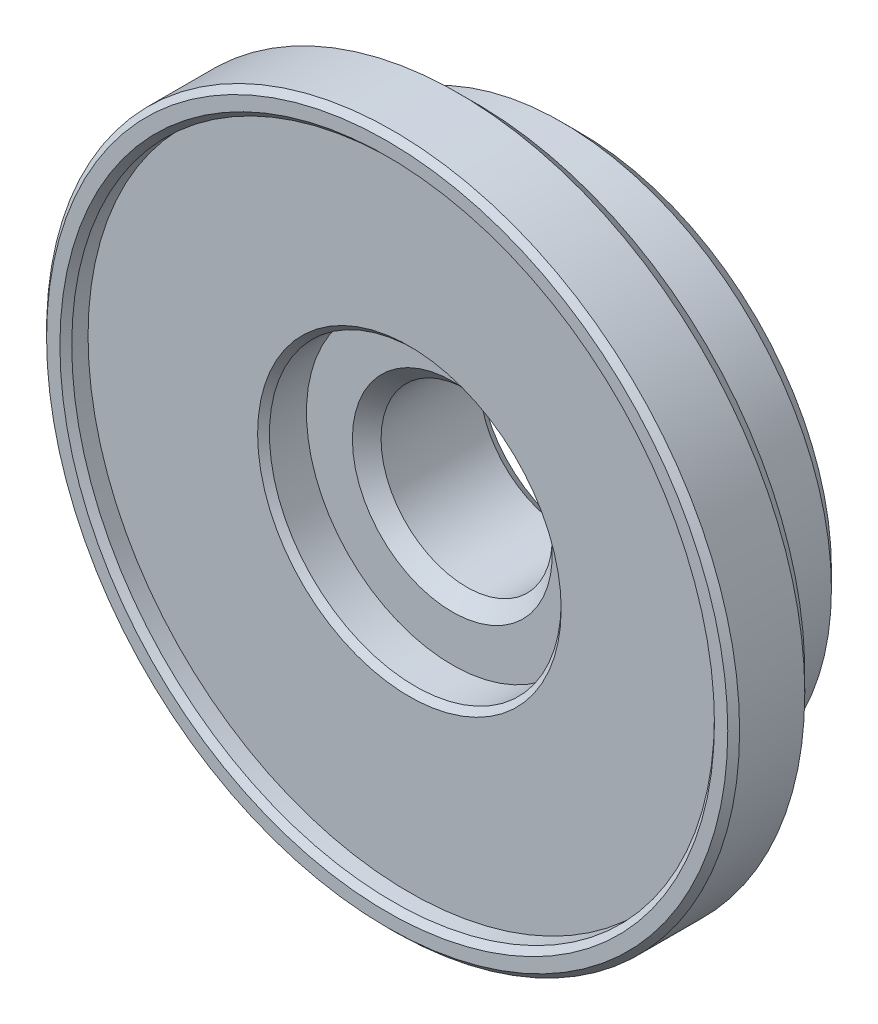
ISO-10303-21;
HEADER;
FILE_DESCRIPTION(('STEP AP214'),'2;1');
FILE_NAME('part.step','',(''),(''),'','','');
FILE_SCHEMA(('AUTOMOTIVE_DESIGN { 1 0 10303 214 1 1 1 1 }'));
ENDSEC;
DATA;
#1=APPLICATION_CONTEXT('core data for automotive mechanical design processes');
#2=APPLICATION_PROTOCOL_DEFINITION('international standard','automotive_design',2000,#1);
#3=PRODUCT_CONTEXT('',#1,'mechanical');
#4=PRODUCT('Part','Part','',(#3));
#5=PRODUCT_RELATED_PRODUCT_CATEGORY('part','',(#4));
#6=PRODUCT_DEFINITION_FORMATION('','',#4);
#7=PRODUCT_DEFINITION_CONTEXT('part definition',#1,'design');
#8=PRODUCT_DEFINITION('design','',#6,#7);
#9=PRODUCT_DEFINITION_SHAPE('','',#8);
#10=(LENGTH_UNIT() NAMED_UNIT(*) SI_UNIT(.MILLI.,.METRE.));
#11=(NAMED_UNIT(*) PLANE_ANGLE_UNIT() SI_UNIT($,.RADIAN.));
#12=(NAMED_UNIT(*) SI_UNIT($,.STERADIAN.) SOLID_ANGLE_UNIT());
#13=UNCERTAINTY_MEASURE_WITH_UNIT(LENGTH_MEASURE(1.E-05),#10,'distance_accuracy_value','');
#14=(GEOMETRIC_REPRESENTATION_CONTEXT(3) GLOBAL_UNCERTAINTY_ASSIGNED_CONTEXT((#13)) GLOBAL_UNIT_ASSIGNED_CONTEXT((#10,
#11,#12)) REPRESENTATION_CONTEXT('',''));
#15=CARTESIAN_POINT('',(0.,0.,0.));
#16=DIRECTION('',(0.,0.,1.));
#17=DIRECTION('',(1.,0.,0.));
#18=AXIS2_PLACEMENT_3D('',#15,#16,#17);
#19=CARTESIAN_POINT('',(0.,0.,-16.51));
#20=DIRECTION('',(0.,0.,1.));
#21=DIRECTION('',(1.,0.,0.));
#22=AXIS2_PLACEMENT_3D('',#19,#20,#21);
#23=CYLINDRICAL_SURFACE('',#22,29.718);
#24=CARTESIAN_POINT('',(0.,0.,-0.508000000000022));
#25=DIRECTION('',(0.,0.,1.));
#26=DIRECTION('',(1.,0.,0.));
#27=AXIS2_PLACEMENT_3D('',#24,#25,#26);
#28=CIRCLE('',#27,29.718);
#29=CARTESIAN_POINT('',(29.718,0.,-0.508000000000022));
#30=VERTEX_POINT('',#29);
#31=EDGE_CURVE('E32',#30,#30,#28,.F.);
#32=ORIENTED_EDGE('',*,*,#31,.T.);
#33=EDGE_LOOP('',(#32));
#34=FACE_BOUND('',#33,.T.);
#35=CARTESIAN_POINT('',(0.,0.,-6.09599999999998));
#36=DIRECTION('',(0.,0.,-1.));
#37=DIRECTION('',(-1.,0.,0.));
#38=AXIS2_PLACEMENT_3D('',#35,#36,#37);
#39=CIRCLE('',#38,29.718);
#40=CARTESIAN_POINT('',(-29.718,0.,-6.09599999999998));
#41=VERTEX_POINT('',#40);
#42=EDGE_CURVE('E57',#41,#41,#39,.F.);
#43=ORIENTED_EDGE('',*,*,#42,.T.);
#44=EDGE_LOOP('',(#43));
#45=FACE_BOUND('',#44,.T.);
#46=ADVANCED_FACE('F14',(#34,#45),#23,.T.);
#47=CARTESIAN_POINT('',(0.,0.,0.));
#48=DIRECTION('',(0.,0.,1.));
#49=DIRECTION('',(1.,0.,0.));
#50=AXIS2_PLACEMENT_3D('',#47,#48,#49);
#51=PLANE('',#50);
#52=CARTESIAN_POINT('',(0.,0.,0.));
#53=DIRECTION('',(0.,0.,1.));
#54=DIRECTION('',(1.,0.,0.));
#55=AXIS2_PLACEMENT_3D('',#52,#53,#54);
#56=CIRCLE('',#55,28.067);
#57=CARTESIAN_POINT('',(28.067,0.,0.));
#58=VERTEX_POINT('',#57);
#59=EDGE_CURVE('E93',#58,#58,#56,.F.);
#60=ORIENTED_EDGE('',*,*,#59,.T.);
#61=EDGE_LOOP('',(#60));
#62=FACE_BOUND('',#61,.T.);
#63=CARTESIAN_POINT('',(0.,0.,0.));
#64=DIRECTION('',(0.,0.,1.));
#65=DIRECTION('',(1.,0.,0.));
#66=AXIS2_PLACEMENT_3D('',#63,#64,#65);
#67=CIRCLE('',#66,29.21);
#68=CARTESIAN_POINT('',(29.21,0.,0.));
#69=VERTEX_POINT('',#68);
#70=EDGE_CURVE('E40',#69,#69,#67,.T.);
#71=ORIENTED_EDGE('',*,*,#70,.T.);
#72=EDGE_LOOP('',(#71));
#73=FACE_BOUND('',#72,.T.);
#74=ADVANCED_FACE('F131',(#62,#73),#51,.T.);
#75=CARTESIAN_POINT('',(0.,0.,-7.62));
#76=DIRECTION('',(0.,0.,-1.));
#77=DIRECTION('',(-1.,0.,0.));
#78=AXIS2_PLACEMENT_3D('',#75,#76,#77);
#79=PLANE('',#78);
#80=CARTESIAN_POINT('',(0.,0.,-7.62));
#81=DIRECTION('',(0.,0.,-1.));
#82=DIRECTION('',(-1.,0.,0.));
#83=AXIS2_PLACEMENT_3D('',#80,#81,#82);
#84=CIRCLE('',#83,23.876);
#85=CARTESIAN_POINT('',(-23.876,0.,-7.62));
#86=VERTEX_POINT('',#85);
#87=EDGE_CURVE('E9',#86,#86,#84,.F.);
#88=ORIENTED_EDGE('',*,*,#87,.T.);
#89=EDGE_LOOP('',(#88));
#90=FACE_BOUND('',#89,.T.);
#91=CARTESIAN_POINT('',(0.,0.,-7.62));
#92=DIRECTION('',(0.,0.,-1.));
#93=DIRECTION('',(-1.,0.,0.));
#94=AXIS2_PLACEMENT_3D('',#91,#92,#93);
#95=CIRCLE('',#94,28.194);
#96=CARTESIAN_POINT('',(-28.194,0.,-7.62));
#97=VERTEX_POINT('',#96);
#98=EDGE_CURVE('E54',#97,#97,#95,.T.);
#99=ORIENTED_EDGE('',*,*,#98,.T.);
#100=EDGE_LOOP('',(#99));
#101=FACE_BOUND('',#100,.T.);
#102=ADVANCED_FACE('F138',(#90,#101),#79,.T.);
#103=CARTESIAN_POINT('',(0.,0.,-7.62));
#104=DIRECTION('',(0.,0.,-1.));
#105=DIRECTION('',(-1.,0.,0.));
#106=AXIS2_PLACEMENT_3D('',#103,#104,#105);
#107=CYLINDRICAL_SURFACE('',#106,23.114);
#108=CARTESIAN_POINT('',(0.,0.,-8.382));
#109=DIRECTION('',(0.,0.,-1.));
#110=DIRECTION('',(-1.,0.,0.));
#111=AXIS2_PLACEMENT_3D('',#108,#109,#110);
#112=CIRCLE('',#111,23.114);
#113=CARTESIAN_POINT('',(-23.114,0.,-8.382));
#114=VERTEX_POINT('',#113);
#115=EDGE_CURVE('E22',#114,#114,#112,.T.);
#116=CARTESIAN_POINT('',(0.,0.,-14.9860000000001));
#117=DIRECTION('',(0.,0.,1.));
#118=DIRECTION('',(1.,0.,0.));
#119=AXIS2_PLACEMENT_3D('',#116,#117,#118);
#120=CIRCLE('',#119,23.114);
#121=CARTESIAN_POINT('',(-23.114,0.,-14.9860000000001));
#122=VERTEX_POINT('',#121);
#123=EDGE_CURVE('E46',#122,#122,#120,.T.);
#124=CARTESIAN_POINT('',(-23.114,0.,-8.382));
#125=CARTESIAN_POINT('',(-23.114,0.,-8.45079166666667));
#126=CARTESIAN_POINT('',(-23.114,0.,-8.51958333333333));
#127=CARTESIAN_POINT('',(-23.114,0.,-8.65716666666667));
#128=CARTESIAN_POINT('',(-23.114,0.,-8.72595833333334));
#129=CARTESIAN_POINT('',(-23.114,0.,-8.86354166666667));
#130=CARTESIAN_POINT('',(-23.114,0.,-8.93233333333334));
#131=CARTESIAN_POINT('',(-23.114,0.,-9.06991666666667));
#132=CARTESIAN_POINT('',(-23.114,0.,-9.13870833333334));
#133=CARTESIAN_POINT('',(-23.114,0.,-9.27629166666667));
#134=CARTESIAN_POINT('',(-23.114,0.,-9.34508333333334));
#135=CARTESIAN_POINT('',(-23.114,0.,-9.48266666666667));
#136=CARTESIAN_POINT('',(-23.114,0.,-9.55145833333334));
#137=CARTESIAN_POINT('',(-23.114,0.,-9.68904166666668));
#138=CARTESIAN_POINT('',(-23.114,0.,-9.75783333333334));
#139=CARTESIAN_POINT('',(-23.114,0.,-9.89541666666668));
#140=CARTESIAN_POINT('',(-23.114,0.,-9.96420833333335));
#141=CARTESIAN_POINT('',(-23.114,0.,-10.1017916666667));
#142=CARTESIAN_POINT('',(-23.114,0.,-10.1705833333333));
#143=CARTESIAN_POINT('',(-23.114,0.,-10.3081666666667));
#144=CARTESIAN_POINT('',(-23.114,0.,-10.3769583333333));
#145=CARTESIAN_POINT('',(-23.114,0.,-10.5145416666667));
#146=CARTESIAN_POINT('',(-23.114,0.,-10.5833333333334));
#147=CARTESIAN_POINT('',(-23.114,0.,-10.7209166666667));
#148=CARTESIAN_POINT('',(-23.114,0.,-10.7897083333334));
#149=CARTESIAN_POINT('',(-23.114,0.,-10.9272916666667));
#150=CARTESIAN_POINT('',(-23.114,0.,-10.9960833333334));
#151=CARTESIAN_POINT('',(-23.114,0.,-11.1336666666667));
#152=CARTESIAN_POINT('',(-23.114,0.,-11.2024583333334));
#153=CARTESIAN_POINT('',(-23.114,0.,-11.3400416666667));
#154=CARTESIAN_POINT('',(-23.114,0.,-11.4088333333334));
#155=CARTESIAN_POINT('',(-23.114,0.,-11.5464166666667));
#156=CARTESIAN_POINT('',(-23.114,0.,-11.6152083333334));
#157=CARTESIAN_POINT('',(-23.114,0.,-11.7527916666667));
#158=CARTESIAN_POINT('',(-23.114,0.,-11.8215833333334));
#159=CARTESIAN_POINT('',(-23.114,0.,-11.9591666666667));
#160=CARTESIAN_POINT('',(-23.114,0.,-12.0279583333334));
#161=CARTESIAN_POINT('',(-23.114,0.,-12.1655416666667));
#162=CARTESIAN_POINT('',(-23.114,0.,-12.2343333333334));
#163=CARTESIAN_POINT('',(-23.114,0.,-12.3719166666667));
#164=CARTESIAN_POINT('',(-23.114,0.,-12.4407083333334));
#165=CARTESIAN_POINT('',(-23.114,0.,-12.5782916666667));
#166=CARTESIAN_POINT('',(-23.114,0.,-12.6470833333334));
#167=CARTESIAN_POINT('',(-23.114,0.,-12.7846666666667));
#168=CARTESIAN_POINT('',(-23.114,0.,-12.8534583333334));
#169=CARTESIAN_POINT('',(-23.114,0.,-12.9910416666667));
#170=CARTESIAN_POINT('',(-23.114,0.,-13.0598333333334));
#171=CARTESIAN_POINT('',(-23.114,0.,-13.1974166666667));
#172=CARTESIAN_POINT('',(-23.114,0.,-13.2662083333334));
#173=CARTESIAN_POINT('',(-23.114,0.,-13.4037916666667));
#174=CARTESIAN_POINT('',(-23.114,0.,-13.4725833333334));
#175=CARTESIAN_POINT('',(-23.114,0.,-13.6101666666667));
#176=CARTESIAN_POINT('',(-23.114,0.,-13.6789583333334));
#177=CARTESIAN_POINT('',(-23.114,0.,-13.8165416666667));
#178=CARTESIAN_POINT('',(-23.114,0.,-13.8853333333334));
#179=CARTESIAN_POINT('',(-23.114,0.,-14.0229166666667));
#180=CARTESIAN_POINT('',(-23.114,0.,-14.0917083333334));
#181=CARTESIAN_POINT('',(-23.114,0.,-14.2292916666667));
#182=CARTESIAN_POINT('',(-23.114,0.,-14.2980833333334));
#183=CARTESIAN_POINT('',(-23.114,0.,-14.4356666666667));
#184=CARTESIAN_POINT('',(-23.114,0.,-14.5044583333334));
#185=CARTESIAN_POINT('',(-23.114,0.,-14.6420416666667));
#186=CARTESIAN_POINT('',(-23.114,0.,-14.7108333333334));
#187=CARTESIAN_POINT('',(-23.114,0.,-14.8484166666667));
#188=CARTESIAN_POINT('',(-23.114,0.,-14.9172083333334));
#189=CARTESIAN_POINT('',(-23.114,0.,-14.9860000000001));
#190=B_SPLINE_CURVE_WITH_KNOTS('',3,(#124,#125,#126,#127,#128,#129,#130,#131,#132,#133,#134,
#135,#136,#137,#138,#139,#140,#141,#142,#143,#144,#145,#146,#147,#148,#149,#150,#151,#152,#153,
#154,#155,#156,#157,#158,#159,#160,#161,#162,#163,#164,#165,#166,#167,#168,#169,#170,#171,#172,
#173,#174,#175,#176,#177,#178,#179,#180,#181,#182,#183,#184,#185,#186,#187,#188,#189),
.UNSPECIFIED.,.F.,.F.,(4,2,2,2,2,2,2,2,2,2,2,2,2,2,2,2,2,2,2,2,2,2,2,2,2,2,2,2,2,2,2,2,4),(0.,
0.206375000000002,0.412750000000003,0.619125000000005,0.825500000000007,1.03187500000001,
1.23825000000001,1.44462500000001,1.65100000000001,1.85737500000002,2.06375000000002,
2.27012500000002,2.47650000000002,2.68287500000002,2.88925000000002,3.09562500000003,
3.30200000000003,3.50837500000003,3.71475000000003,3.92112500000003,4.12750000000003,
4.33387500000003,4.54025000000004,4.74662500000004,4.95300000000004,5.15937500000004,
5.36575000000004,5.57212500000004,5.77850000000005,5.98487500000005,6.19125000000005,
6.39762500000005,6.60400000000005),.UNSPECIFIED.);
#191=EDGE_CURVE('BSEAM111',#114,#122,#190,.T.);
#192=ORIENTED_EDGE('',*,*,#115,.T.);
#193=ORIENTED_EDGE('',*,*,#123,.T.);
#194=ORIENTED_EDGE('',*,*,#191,.T.);
#195=ORIENTED_EDGE('',*,*,#191,.F.);
#196=EDGE_LOOP('',(#192,#194,#193,#195));
#197=FACE_BOUND('',#196,.T.);
#198=ADVANCED_FACE('F111',(#197),#107,.T.);
#199=CARTESIAN_POINT('',(0.,0.,-16.51));
#200=DIRECTION('',(0.,0.,1.));
#201=DIRECTION('',(1.,0.,0.));
#202=AXIS2_PLACEMENT_3D('',#199,#200,#201);
#203=PLANE('',#202);
#204=CARTESIAN_POINT('',(0.,0.,-16.51));
#205=DIRECTION('',(0.,0.,-1.));
#206=DIRECTION('',(-1.,0.,0.));
#207=AXIS2_PLACEMENT_3D('',#204,#205,#206);
#208=CIRCLE('',#207,8.5725);
#209=CARTESIAN_POINT('',(-8.5725,0.,-16.51));
#210=VERTEX_POINT('',#209);
#211=EDGE_CURVE('E97',#210,#210,#208,.T.);
#212=ORIENTED_EDGE('',*,*,#211,.F.);
#213=EDGE_LOOP('',(#212));
#214=FACE_BOUND('',#213,.T.);
#215=CARTESIAN_POINT('',(0.,0.,-16.51));
#216=DIRECTION('',(0.,0.,1.));
#217=DIRECTION('',(1.,0.,0.));
#218=AXIS2_PLACEMENT_3D('',#215,#216,#217);
#219=CIRCLE('',#218,21.59);
#220=CARTESIAN_POINT('',(21.59,0.,-16.51));
#221=VERTEX_POINT('',#220);
#222=EDGE_CURVE('E50',#221,#221,#219,.F.);
#223=ORIENTED_EDGE('',*,*,#222,.T.);
#224=EDGE_LOOP('',(#223));
#225=FACE_BOUND('',#224,.T.);
#226=ADVANCED_FACE('F107',(#214,#225),#203,.F.);
#227=CARTESIAN_POINT('',(0.,0.,-6.09599999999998));
#228=DIRECTION('',(0.,0.,1.));
#229=DIRECTION('',(1.,0.,0.));
#230=AXIS2_PLACEMENT_3D('',#227,#228,#229);
#231=CONICAL_SURFACE('',#230,29.718,0.785398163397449);
#232=ORIENTED_EDGE('',*,*,#98,.F.);
#233=EDGE_LOOP('',(#232));
#234=FACE_BOUND('',#233,.T.);
#235=ORIENTED_EDGE('',*,*,#42,.F.);
#236=EDGE_LOOP('',(#235));
#237=FACE_BOUND('',#236,.T.);
#238=ADVANCED_FACE('F110',(#234,#237),#231,.T.);
#239=CARTESIAN_POINT('',(0.,0.,-16.51));
#240=DIRECTION('',(0.,0.,1.));
#241=DIRECTION('',(1.,0.,0.));
#242=AXIS2_PLACEMENT_3D('',#239,#240,#241);
#243=CONICAL_SURFACE('',#242,21.59,0.785398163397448);
#244=ORIENTED_EDGE('',*,*,#123,.F.);
#245=EDGE_LOOP('',(#244));
#246=FACE_BOUND('',#245,.T.);
#247=ORIENTED_EDGE('',*,*,#222,.F.);
#248=EDGE_LOOP('',(#247));
#249=FACE_BOUND('',#248,.T.);
#250=ADVANCED_FACE('F115',(#246,#249),#243,.T.);
#251=CARTESIAN_POINT('',(0.,0.,0.));
#252=DIRECTION('',(0.,0.,-1.));
#253=DIRECTION('',(-1.,0.,0.));
#254=AXIS2_PLACEMENT_3D('',#251,#252,#253);
#255=CONICAL_SURFACE('',#254,29.21,0.785398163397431);
#256=ORIENTED_EDGE('',*,*,#31,.F.);
#257=EDGE_LOOP('',(#256));
#258=FACE_BOUND('',#257,.T.);
#259=ORIENTED_EDGE('',*,*,#70,.F.);
#260=EDGE_LOOP('',(#259));
#261=FACE_BOUND('',#260,.T.);
#262=ADVANCED_FACE('F117',(#258,#261),#255,.T.);
#263=CARTESIAN_POINT('',(0.,0.,-8.382));
#264=DIRECTION('',(0.,0.,-1.));
#265=DIRECTION('',(-1.,0.,0.));
#266=AXIS2_PLACEMENT_3D('',#263,#264,#265);
#267=TOROIDAL_SURFACE('',#266,23.876,0.762);
#268=ORIENTED_EDGE('',*,*,#87,.F.);
#269=EDGE_LOOP('',(#268));
#270=FACE_BOUND('',#269,.T.);
#271=ORIENTED_EDGE('',*,*,#115,.F.);
#272=EDGE_LOOP('',(#271));
#273=FACE_BOUND('',#272,.T.);
#274=ADVANCED_FACE('F16',(#270,#273),#267,.F.);
#275=CARTESIAN_POINT('',(0.,0.,-0.507999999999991));
#276=DIRECTION('',(0.,0.,1.));
#277=DIRECTION('',(1.,0.,0.));
#278=AXIS2_PLACEMENT_3D('',#275,#276,#277);
#279=CONICAL_SURFACE('',#278,27.559,0.785398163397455);
#280=ORIENTED_EDGE('',*,*,#59,.F.);
#281=EDGE_LOOP('',(#280));
#282=FACE_BOUND('',#281,.T.);
#283=CARTESIAN_POINT('',(0.,0.,-0.507999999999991));
#284=DIRECTION('',(0.,0.,1.));
#285=DIRECTION('',(1.,0.,0.));
#286=AXIS2_PLACEMENT_3D('',#283,#284,#285);
#287=CIRCLE('',#286,27.559);
#288=CARTESIAN_POINT('',(27.559,0.,-0.507999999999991));
#289=VERTEX_POINT('',#288);
#290=EDGE_CURVE('E85',#289,#289,#287,.T.);
#291=ORIENTED_EDGE('',*,*,#290,.F.);
#292=EDGE_LOOP('',(#291));
#293=FACE_BOUND('',#292,.T.);
#294=ADVANCED_FACE('F147',(#282,#293),#279,.F.);
#295=CARTESIAN_POINT('',(0.,0.,-16.51));
#296=DIRECTION('',(0.,0.,-1.));
#297=DIRECTION('',(-1.,0.,0.));
#298=AXIS2_PLACEMENT_3D('',#295,#296,#297);
#299=CONICAL_SURFACE('',#298,8.5725,0.78539816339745);
#300=CARTESIAN_POINT('',(0.,0.,-15.279751));
#301=DIRECTION('',(0.,0.,-1.));
#302=DIRECTION('',(-1.,0.,0.));
#303=AXIS2_PLACEMENT_3D('',#300,#301,#302);
#304=CIRCLE('',#303,7.342251);
#305=CARTESIAN_POINT('',(-7.342251,0.,-15.279751));
#306=VERTEX_POINT('',#305);
#307=EDGE_CURVE('E61',#306,#306,#304,.T.);
#308=ORIENTED_EDGE('',*,*,#307,.F.);
#309=EDGE_LOOP('',(#308));
#310=FACE_BOUND('',#309,.T.);
#311=ORIENTED_EDGE('',*,*,#211,.T.);
#312=EDGE_LOOP('',(#311));
#313=FACE_BOUND('',#312,.T.);
#314=ADVANCED_FACE('F105',(#310,#313),#299,.F.);
#315=CARTESIAN_POINT('',(0.,0.,-16.51));
#316=DIRECTION('',(0.,0.,-1.));
#317=DIRECTION('',(-1.,0.,0.));
#318=AXIS2_PLACEMENT_3D('',#315,#316,#317);
#319=CYLINDRICAL_SURFACE('',#318,7.342251);
#320=CARTESIAN_POINT('',(0.,0.,-6.818249));
#321=DIRECTION('',(0.,0.,-1.));
#322=DIRECTION('',(-1.,0.,0.));
#323=AXIS2_PLACEMENT_3D('',#320,#321,#322);
#324=CIRCLE('',#323,7.342251);
#325=CARTESIAN_POINT('',(-7.342251,0.,-6.818249));
#326=VERTEX_POINT('',#325);
#327=EDGE_CURVE('E65',#326,#326,#324,.T.);
#328=ORIENTED_EDGE('',*,*,#327,.F.);
#329=EDGE_LOOP('',(#328));
#330=FACE_BOUND('',#329,.T.);
#331=ORIENTED_EDGE('',*,*,#307,.T.);
#332=EDGE_LOOP('',(#331));
#333=FACE_BOUND('',#332,.T.);
#334=ADVANCED_FACE('F153',(#330,#333),#319,.F.);
#335=CARTESIAN_POINT('',(0.,0.,-6.818249));
#336=DIRECTION('',(0.,0.,1.));
#337=DIRECTION('',(1.,0.,0.));
#338=AXIS2_PLACEMENT_3D('',#335,#336,#337);
#339=CONICAL_SURFACE('',#338,7.342251,0.785398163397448);
#340=CARTESIAN_POINT('',(0.,0.,-5.588));
#341=DIRECTION('',(0.,0.,-1.));
#342=DIRECTION('',(-1.,0.,0.));
#343=AXIS2_PLACEMENT_3D('',#340,#341,#342);
#344=CIRCLE('',#343,8.5725);
#345=CARTESIAN_POINT('',(-8.5725,0.,-5.588));
#346=VERTEX_POINT('',#345);
#347=EDGE_CURVE('E69',#346,#346,#344,.T.);
#348=ORIENTED_EDGE('',*,*,#347,.F.);
#349=EDGE_LOOP('',(#348));
#350=FACE_BOUND('',#349,.T.);
#351=ORIENTED_EDGE('',*,*,#327,.T.);
#352=EDGE_LOOP('',(#351));
#353=FACE_BOUND('',#352,.T.);
#354=ADVANCED_FACE('F157',(#350,#353),#339,.F.);
#355=CARTESIAN_POINT('',(0.,0.,-5.588));
#356=DIRECTION('',(0.,0.,1.));
#357=DIRECTION('',(1.,0.,0.));
#358=AXIS2_PLACEMENT_3D('',#355,#356,#357);
#359=PLANE('',#358);
#360=ORIENTED_EDGE('',*,*,#347,.T.);
#361=EDGE_LOOP('',(#360));
#362=FACE_BOUND('',#361,.T.);
#363=CARTESIAN_POINT('',(0.,0.,-5.588));
#364=DIRECTION('',(0.,0.,1.));
#365=DIRECTION('',(1.,0.,0.));
#366=AXIS2_PLACEMENT_3D('',#363,#364,#365);
#367=CIRCLE('',#366,12.5095);
#368=CARTESIAN_POINT('',(12.5095,0.,-5.588));
#369=VERTEX_POINT('',#368);
#370=EDGE_CURVE('E73',#369,#369,#367,.T.);
#371=ORIENTED_EDGE('',*,*,#370,.T.);
#372=EDGE_LOOP('',(#371));
#373=FACE_BOUND('',#372,.T.);
#374=ADVANCED_FACE('F161',(#362,#373),#359,.T.);
#375=CARTESIAN_POINT('',(0.,0.,-5.588));
#376=DIRECTION('',(0.,0.,1.));
#377=DIRECTION('',(1.,0.,0.));
#378=AXIS2_PLACEMENT_3D('',#375,#376,#377);
#379=CYLINDRICAL_SURFACE('',#378,12.5095);
#380=CARTESIAN_POINT('',(0.,0.,-2.41299999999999));
#381=DIRECTION('',(0.,0.,1.));
#382=DIRECTION('',(1.,0.,0.));
#383=AXIS2_PLACEMENT_3D('',#380,#381,#382);
#384=CIRCLE('',#383,12.5095);
#385=CARTESIAN_POINT('',(12.5095,0.,-2.41299999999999));
#386=VERTEX_POINT('',#385);
#387=EDGE_CURVE('E77',#386,#386,#384,.T.);
#388=ORIENTED_EDGE('',*,*,#387,.T.);
#389=EDGE_LOOP('',(#388));
#390=FACE_BOUND('',#389,.T.);
#391=ORIENTED_EDGE('',*,*,#370,.F.);
#392=EDGE_LOOP('',(#391));
#393=FACE_BOUND('',#392,.T.);
#394=ADVANCED_FACE('F165',(#390,#393),#379,.F.);
#395=CARTESIAN_POINT('',(0.,0.,-1.905));
#396=DIRECTION('',(0.,0.,1.));
#397=DIRECTION('',(1.,0.,0.));
#398=AXIS2_PLACEMENT_3D('',#395,#396,#397);
#399=CONICAL_SURFACE('',#398,13.0175,0.785398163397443);
#400=ORIENTED_EDGE('',*,*,#387,.F.);
#401=EDGE_LOOP('',(#400));
#402=FACE_BOUND('',#401,.T.);
#403=CARTESIAN_POINT('',(0.,0.,-1.905));
#404=DIRECTION('',(0.,0.,1.));
#405=DIRECTION('',(1.,0.,0.));
#406=AXIS2_PLACEMENT_3D('',#403,#404,#405);
#407=CIRCLE('',#406,13.0175);
#408=CARTESIAN_POINT('',(13.0175,0.,-1.905));
#409=VERTEX_POINT('',#408);
#410=EDGE_CURVE('E81',#409,#409,#407,.F.);
#411=ORIENTED_EDGE('',*,*,#410,.F.);
#412=EDGE_LOOP('',(#411));
#413=FACE_BOUND('',#412,.T.);
#414=ADVANCED_FACE('F169',(#402,#413),#399,.F.);
#415=CARTESIAN_POINT('',(0.,0.,-1.905));
#416=DIRECTION('',(0.,0.,1.));
#417=DIRECTION('',(1.,0.,0.));
#418=AXIS2_PLACEMENT_3D('',#415,#416,#417);
#419=PLANE('',#418);
#420=ORIENTED_EDGE('',*,*,#410,.T.);
#421=EDGE_LOOP('',(#420));
#422=FACE_BOUND('',#421,.T.);
#423=CARTESIAN_POINT('',(0.,0.,-1.905));
#424=DIRECTION('',(0.,0.,1.));
#425=DIRECTION('',(1.,0.,0.));
#426=AXIS2_PLACEMENT_3D('',#423,#424,#425);
#427=CIRCLE('',#426,27.559);
#428=CARTESIAN_POINT('',(27.559,0.,-1.905));
#429=VERTEX_POINT('',#428);
#430=EDGE_CURVE('E89',#429,#429,#427,.F.);
#431=ORIENTED_EDGE('',*,*,#430,.F.);
#432=EDGE_LOOP('',(#431));
#433=FACE_BOUND('',#432,.T.);
#434=ADVANCED_FACE('F173',(#422,#433),#419,.T.);
#435=CARTESIAN_POINT('',(0.,0.,-4.699));
#436=DIRECTION('',(0.,0.,1.));
#437=DIRECTION('',(1.,0.,0.));
#438=AXIS2_PLACEMENT_3D('',#435,#436,#437);
#439=CYLINDRICAL_SURFACE('',#438,27.559);
#440=ORIENTED_EDGE('',*,*,#430,.T.);
#441=EDGE_LOOP('',(#440));
#442=FACE_BOUND('',#441,.T.);
#443=ORIENTED_EDGE('',*,*,#290,.T.);
#444=EDGE_LOOP('',(#443));
#445=FACE_BOUND('',#444,.T.);
#446=ADVANCED_FACE('F177',(#442,#445),#439,.F.);
#447=CLOSED_SHELL('',(#46,#74,#102,#198,#226,#238,#250,#262,#274,#294,#314,#334,#354,#374,#394,
#414,#434,#446));
#448=MANIFOLD_SOLID_BREP('B1',#447);
#449=ADVANCED_BREP_SHAPE_REPRESENTATION('',(#18,#448),#14);
#450=SHAPE_DEFINITION_REPRESENTATION(#9,#449);
ENDSEC;
END-ISO-10303-21;
